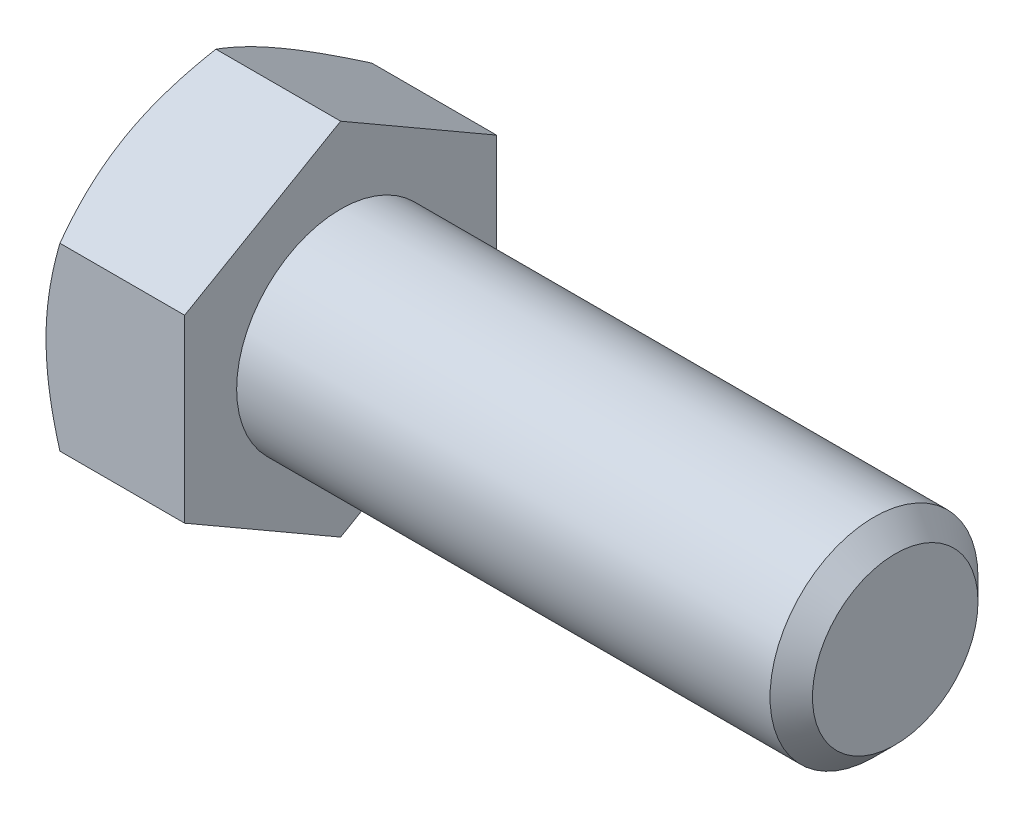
ISO-10303-21;
HEADER;
FILE_DESCRIPTION(('STEP AP214'),'2;1');
FILE_NAME('part.step','',(''),(''),'','','');
FILE_SCHEMA(('AUTOMOTIVE_DESIGN { 1 0 10303 214 1 1 1 1 }'));
ENDSEC;
DATA;
#1=APPLICATION_CONTEXT('core data for automotive mechanical design processes');
#2=APPLICATION_PROTOCOL_DEFINITION('international standard','automotive_design',2000,#1);
#3=PRODUCT_CONTEXT('',#1,'mechanical');
#4=PRODUCT('Part','Part','',(#3));
#5=PRODUCT_RELATED_PRODUCT_CATEGORY('part','',(#4));
#6=PRODUCT_DEFINITION_FORMATION('','',#4);
#7=PRODUCT_DEFINITION_CONTEXT('part definition',#1,'design');
#8=PRODUCT_DEFINITION('design','',#6,#7);
#9=PRODUCT_DEFINITION_SHAPE('','',#8);
#10=(LENGTH_UNIT() NAMED_UNIT(*) SI_UNIT(.MILLI.,.METRE.));
#11=(NAMED_UNIT(*) PLANE_ANGLE_UNIT() SI_UNIT($,.RADIAN.));
#12=(NAMED_UNIT(*) SI_UNIT($,.STERADIAN.) SOLID_ANGLE_UNIT());
#13=UNCERTAINTY_MEASURE_WITH_UNIT(LENGTH_MEASURE(1.E-05),#10,'distance_accuracy_value','');
#14=(GEOMETRIC_REPRESENTATION_CONTEXT(3) GLOBAL_UNCERTAINTY_ASSIGNED_CONTEXT((#13)) GLOBAL_UNIT_ASSIGNED_CONTEXT((#10,
#11,#12)) REPRESENTATION_CONTEXT('',''));
#15=CARTESIAN_POINT('',(0.,0.,0.));
#16=DIRECTION('',(0.,0.,1.));
#17=DIRECTION('',(1.,0.,0.));
#18=AXIS2_PLACEMENT_3D('',#15,#16,#17);
#19=CARTESIAN_POINT('',(-15.875,-4.12444598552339,7.14375));
#20=DIRECTION('',(0.,0.,-1.));
#21=DIRECTION('',(0.,1.,0.));
#22=AXIS2_PLACEMENT_3D('',#19,#20,#21);
#23=PLANE('',#22);
#24=CARTESIAN_POINT('',(-12.2837107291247,-11.2944476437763,7.14375));
#25=CARTESIAN_POINT('',(-12.4368470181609,-10.9805232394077,7.14375));
#26=CARTESIAN_POINT('',(-12.5885759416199,-10.6659008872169,7.14375));
#27=CARTESIAN_POINT('',(-12.8884314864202,-10.0348898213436,7.14375));
#28=CARTESIAN_POINT('',(-13.0365575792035,-9.71850085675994,7.14375));
#29=CARTESIAN_POINT('',(-13.3291194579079,-9.08205743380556,7.14375));
#30=CARTESIAN_POINT('',(-13.4735325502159,-8.76199250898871,7.14375));
#31=CARTESIAN_POINT('',(-13.756729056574,-8.1193909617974,7.14375));
#32=CARTESIAN_POINT('',(-13.8955127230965,-7.79685445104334,7.14375));
#33=CARTESIAN_POINT('',(-14.1706162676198,-7.13766604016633,7.14375));
#34=CARTESIAN_POINT('',(-14.3066876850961,-6.80090989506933,7.14375));
#35=CARTESIAN_POINT('',(-14.5690446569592,-6.12353919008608,7.14375));
#36=CARTESIAN_POINT('',(-14.6953291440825,-5.78292421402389,7.14375));
#37=CARTESIAN_POINT('',(-14.9349543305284,-5.09786024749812,7.14375));
#38=CARTESIAN_POINT('',(-15.048319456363,-4.75341989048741,7.14375));
#39=CARTESIAN_POINT('',(-15.2586129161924,-4.05961513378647,7.14375));
#40=CARTESIAN_POINT('',(-15.3555462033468,-3.71025225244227,7.14375));
#41=CARTESIAN_POINT('',(-15.5279472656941,-3.00829070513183,7.14375));
#42=CARTESIAN_POINT('',(-15.6035368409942,-2.65572276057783,7.14375));
#43=CARTESIAN_POINT('',(-15.6977473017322,-2.12349462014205,7.14375));
#44=CARTESIAN_POINT('',(-15.7259563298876,-1.94551103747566,7.14375));
#45=CARTESIAN_POINT('',(-15.7754356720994,-1.58858869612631,7.14375));
#46=CARTESIAN_POINT('',(-15.7967066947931,-1.40965003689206,7.14375));
#47=CARTESIAN_POINT('',(-15.8316079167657,-1.05348730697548,7.14375));
#48=CARTESIAN_POINT('',(-15.8453382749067,-0.87627309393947,7.14375));
#49=CARTESIAN_POINT('',(-15.8652847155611,-0.521422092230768,7.14375));
#50=CARTESIAN_POINT('',(-15.8715009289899,-0.343785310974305,7.14375));
#51=CARTESIAN_POINT('',(-15.8762697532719,0.0115936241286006,7.14375));
#52=CARTESIAN_POINT('',(-15.8748223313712,0.189335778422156,7.14375));
#53=CARTESIAN_POINT('',(-15.8643014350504,0.54459618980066,7.14375));
#54=CARTESIAN_POINT('',(-15.8552276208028,0.722114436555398,7.14375));
#55=CARTESIAN_POINT('',(-15.8249195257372,1.14231672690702,7.14375));
#56=CARTESIAN_POINT('',(-15.8004249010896,1.38477115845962,7.14375));
#57=CARTESIAN_POINT('',(-15.7384979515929,1.86800860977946,7.14375));
#58=CARTESIAN_POINT('',(-15.7010640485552,2.10879142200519,7.14375));
#59=CARTESIAN_POINT('',(-15.5713280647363,2.82827840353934,7.14375));
#60=CARTESIAN_POINT('',(-15.4616106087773,3.30389106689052,7.14375));
#61=CARTESIAN_POINT('',(-15.2696836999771,4.01550298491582,7.14375));
#62=CARTESIAN_POINT('',(-15.2001876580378,4.2551445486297,7.14375));
#63=CARTESIAN_POINT('',(-15.0535636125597,4.73210450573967,7.14375));
#64=CARTESIAN_POINT('',(-14.9764355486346,4.96942288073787,7.14375));
#65=CARTESIAN_POINT('',(-14.8158189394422,5.4418061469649,7.14375));
#66=CARTESIAN_POINT('',(-14.7323321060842,5.67687162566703,7.14375));
#67=CARTESIAN_POINT('',(-14.5600214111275,6.14502503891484,7.14375));
#68=CARTESIAN_POINT('',(-14.4711976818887,6.37811302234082,7.14375));
#69=CARTESIAN_POINT('',(-14.220948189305,7.01633974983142,7.14375));
#70=CARTESIAN_POINT('',(-14.0549401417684,7.41968025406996,7.14375));
#71=CARTESIAN_POINT('',(-13.7128746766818,8.22209357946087,7.14375));
#72=CARTESIAN_POINT('',(-13.5368160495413,8.62116588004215,7.14375));
#73=CARTESIAN_POINT('',(-13.1770756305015,9.41604681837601,7.14375));
#74=CARTESIAN_POINT('',(-12.99339071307,9.81185403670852,7.14375));
#75=CARTESIAN_POINT('',(-12.6202597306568,10.600712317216,7.14375));
#76=CARTESIAN_POINT('',(-12.4308139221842,10.9937635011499,7.14375));
#77=CARTESIAN_POINT('',(-12.0471131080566,11.7783335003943,7.14375));
#78=CARTESIAN_POINT('',(-11.8528504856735,12.1698485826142,7.14375));
#79=CARTESIAN_POINT('',(-11.4607727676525,12.9510972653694,7.14375));
#80=CARTESIAN_POINT('',(-11.2629576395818,13.3408308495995,7.14375));
#81=CARTESIAN_POINT('',(-10.8645317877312,14.1187472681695,7.14375));
#82=CARTESIAN_POINT('',(-10.66392174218,14.5069304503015,7.14375));
#83=CARTESIAN_POINT('',(-10.2603913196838,15.2820948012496,7.14375));
#84=CARTESIAN_POINT('',(-10.0574709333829,15.6690759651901,7.14375));
#85=CARTESIAN_POINT('',(-9.49034733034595,16.7442233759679,7.14375));
#86=CARTESIAN_POINT('',(-9.12409176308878,17.4313067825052,7.14375));
#87=CARTESIAN_POINT('',(-8.38723567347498,18.8031936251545,7.14375));
#88=CARTESIAN_POINT('',(-8.01663486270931,19.4879969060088,7.14375));
#89=CARTESIAN_POINT('',(-7.27352014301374,20.8534506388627,7.14375));
#90=CARTESIAN_POINT('',(-6.90101750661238,21.5341072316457,7.14375));
#91=CARTESIAN_POINT('',(-6.15355512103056,22.8939962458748,7.14375));
#92=CARTESIAN_POINT('',(-5.77859558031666,23.5732287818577,7.14375));
#93=CARTESIAN_POINT('',(-5.402745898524,24.2519647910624,7.14374999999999));
#94=B_SPLINE_CURVE_WITH_KNOTS('',3,(#24,#25,#26,#27,#28,#29,#30,#31,#32,#33,#34,#35,#36,#37,#38,
#39,#40,#41,#42,#43,#44,#45,#46,#47,#48,#49,#50,#51,#52,#53,#54,#55,#56,#57,#58,#59,#60,#61,#62,
#63,#64,#65,#66,#67,#68,#69,#70,#71,#72,#73,#74,#75,#76,#77,#78,#79,#80,#81,#82,#83,#84,#85,#86,
#87,#88,#89,#90,#91,#92,#93),.UNSPECIFIED.,.F.,.F.,(4,2,2,2,2,2,2,2,2,2,2,2,2,2,2,2,2,2,2,2,2,2,
2,2,2,2,2,2,2,2,2,2,2,2,4),(0.,1.04786354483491,2.0958799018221,3.14924522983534,
4.20256326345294,5.2920693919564,6.38169416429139,7.46922336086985,8.55642415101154,
9.63728918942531,10.1777908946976,10.7182373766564,11.2513201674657,11.7843936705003,
12.3174694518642,12.8505689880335,13.5812265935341,14.3119733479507,15.7741561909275,
16.522632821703,17.2711153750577,18.0193971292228,18.7676603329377,20.0759569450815,
21.384411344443,22.6934073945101,24.002345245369,25.3135047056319,26.6246761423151,
27.9355347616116,29.2463986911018,31.5821913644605,33.9181399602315,36.245893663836,
38.573452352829),.UNSPECIFIED.);
#95=CARTESIAN_POINT('',(-15.2369459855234,-4.12444598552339,7.14375));
#96=VERTEX_POINT('',#95);
#97=CARTESIAN_POINT('',(-15.875,0.,7.14375));
#98=VERTEX_POINT('',#97);
#99=EDGE_CURVE('E251',#96,#98,#94,.T.);
#100=ORIENTED_EDGE('',*,*,#99,.F.);
#101=DIRECTION('',(1.,0.,0.));
#102=VECTOR('',#101,1.);
#103=CARTESIAN_POINT('',(-15.875,-4.12444598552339,7.14375));
#104=LINE('',#103,#102);
#105=CARTESIAN_POINT('',(-9.525,-4.12444598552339,7.14375));
#106=VERTEX_POINT('',#105);
#107=EDGE_CURVE('E254',#96,#106,#104,.T.);
#108=ORIENTED_EDGE('',*,*,#107,.T.);
#109=DIRECTION('',(0.,1.,0.));
#110=VECTOR('',#109,1.);
#111=CARTESIAN_POINT('',(-9.525,-4.12444598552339,7.14375));
#112=LINE('',#111,#110);
#113=CARTESIAN_POINT('',(-9.525,4.12444598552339,7.14375));
#114=VERTEX_POINT('',#113);
#115=EDGE_CURVE('E256',#106,#114,#112,.T.);
#116=ORIENTED_EDGE('',*,*,#115,.T.);
#117=DIRECTION('',(1.,0.,0.));
#118=VECTOR('',#117,1.);
#119=CARTESIAN_POINT('',(-15.875,4.12444598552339,7.14375));
#120=LINE('',#119,#118);
#121=CARTESIAN_POINT('',(-15.2369459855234,4.12444598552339,7.14375));
#122=VERTEX_POINT('',#121);
#123=EDGE_CURVE('E224',#122,#114,#120,.T.);
#124=ORIENTED_EDGE('',*,*,#123,.F.);
#125=EDGE_CURVE('E114',#98,#122,#94,.T.);
#126=ORIENTED_EDGE('',*,*,#125,.F.);
#127=EDGE_LOOP('',(#100,#108,#116,#124,#126));
#128=FACE_BOUND('',#127,.T.);
#129=ADVANCED_FACE('F38',(#128),#23,.F.);
#130=CARTESIAN_POINT('',(-15.875,4.12444598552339,7.14375));
#131=DIRECTION('',(0.,-0.866025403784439,-0.5));
#132=DIRECTION('',(0.,0.5,-0.866025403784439));
#133=AXIS2_PLACEMENT_3D('',#130,#131,#132);
#134=PLANE('',#133);
#135=CARTESIAN_POINT('',(-15.2368793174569,4.12433051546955,7.14395));
#136=CARTESIAN_POINT('',(-15.28921396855,4.21499047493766,6.98692234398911));
#137=CARTESIAN_POINT('',(-15.3391734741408,4.30598845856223,6.82930921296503));
#138=CARTESIAN_POINT('',(-15.4336880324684,4.48872342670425,6.51280296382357));
#139=CARTESIAN_POINT('',(-15.4782407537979,4.58046071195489,6.35390932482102));
#140=CARTESIAN_POINT('',(-15.6029142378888,4.85714139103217,5.87468433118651));
#141=CARTESIAN_POINT('',(-15.6738270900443,5.04317693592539,5.55246131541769));
#142=CARTESIAN_POINT('',(-15.7569807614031,5.32157574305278,5.07026043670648));
#143=CARTESIAN_POINT('',(-15.7806688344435,5.41310718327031,4.91172333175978));
#144=CARTESIAN_POINT('',(-15.8203902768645,5.59658364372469,4.59393278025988));
#145=CARTESIAN_POINT('',(-15.8364243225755,5.6885286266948,4.43467939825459));
#146=CARTESIAN_POINT('',(-15.860429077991,5.87257827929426,4.11589604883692));
#147=CARTESIAN_POINT('',(-15.8684089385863,5.96468264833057,3.95636660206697));
#148=CARTESIAN_POINT('',(-15.8761427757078,6.14897138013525,3.63716915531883));
#149=CARTESIAN_POINT('',(-15.8758970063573,6.24115574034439,3.47750115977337));
#150=CARTESIAN_POINT('',(-15.8639170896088,6.49371006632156,3.04006423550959));
#151=CARTESIAN_POINT('',(-15.843806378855,6.65399735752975,2.76243850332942));
#152=CARTESIAN_POINT('',(-15.780035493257,6.97350732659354,2.20903100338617));
#153=CARTESIAN_POINT('',(-15.7363535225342,7.13272888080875,1.93325118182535));
#154=CARTESIAN_POINT('',(-15.6271614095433,7.45288184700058,1.37872997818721));
#155=CARTESIAN_POINT('',(-15.5611886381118,7.61377286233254,1.10005856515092));
#156=CARTESIAN_POINT('',(-15.4114571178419,7.93315557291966,0.546871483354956));
#157=CARTESIAN_POINT('',(-15.3277335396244,8.09165135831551,0.272348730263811));
#158=CARTESIAN_POINT('',(-15.2368793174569,8.24900744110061,-0.000200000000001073));
#159=B_SPLINE_CURVE_WITH_KNOTS('',3,(#135,#136,#137,#138,#139,#140,#141,#142,#143,#144,#145,
#146,#147,#148,#149,#150,#151,#152,#153,#154,#155,#156,#157,#158),.UNSPECIFIED.,.F.,.F.,(4,2,2,
2,2,2,2,2,2,2,2,4),(0.,0.566119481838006,1.13248221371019,2.2675610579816,2.82119915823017,
3.37478832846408,3.92774781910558,4.48069022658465,5.44329448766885,6.4067903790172,
7.39165514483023,8.37458648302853),.UNSPECIFIED.);
#160=CARTESIAN_POINT('',(-15.875,6.18666897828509,3.571875));
#161=VERTEX_POINT('',#160);
#162=EDGE_CURVE('E110',#122,#161,#159,.T.);
#163=ORIENTED_EDGE('',*,*,#162,.F.);
#164=ORIENTED_EDGE('',*,*,#123,.T.);
#165=DIRECTION('',(0.,0.5,-0.866025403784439));
#166=VECTOR('',#165,1.);
#167=CARTESIAN_POINT('',(-9.525,4.12444598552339,7.14375));
#168=LINE('',#167,#166);
#169=CARTESIAN_POINT('',(-9.525,8.24889197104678,0.));
#170=VERTEX_POINT('',#169);
#171=EDGE_CURVE('E274',#114,#170,#168,.T.);
#172=ORIENTED_EDGE('',*,*,#171,.T.);
#173=DIRECTION('',(1.,0.,0.));
#174=VECTOR('',#173,1.);
#175=CARTESIAN_POINT('',(-15.875,8.24889197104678,0.));
#176=LINE('',#175,#174);
#177=CARTESIAN_POINT('',(-15.2369459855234,8.24889197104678,0.));
#178=VERTEX_POINT('',#177);
#179=EDGE_CURVE('E133',#178,#170,#176,.T.);
#180=ORIENTED_EDGE('',*,*,#179,.F.);
#181=EDGE_CURVE('E118',#161,#178,#159,.T.);
#182=ORIENTED_EDGE('',*,*,#181,.F.);
#183=EDGE_LOOP('',(#163,#164,#172,#180,#182));
#184=FACE_BOUND('',#183,.T.);
#185=ADVANCED_FACE('F131',(#184),#134,.F.);
#186=CARTESIAN_POINT('',(-15.875,8.24889197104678,0.));
#187=DIRECTION('',(0.,-0.866025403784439,0.5));
#188=DIRECTION('',(0.,-0.5,-0.866025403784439));
#189=AXIS2_PLACEMENT_3D('',#186,#187,#188);
#190=PLANE('',#189);
#191=CARTESIAN_POINT('',(-15.2368793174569,8.24900744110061,0.000199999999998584));
#192=CARTESIAN_POINT('',(-15.28921396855,8.15834748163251,-0.156827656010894));
#193=CARTESIAN_POINT('',(-15.3391734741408,8.06734949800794,-0.314440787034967));
#194=CARTESIAN_POINT('',(-15.4336880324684,7.88461452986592,-0.630947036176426));
#195=CARTESIAN_POINT('',(-15.4782407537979,7.79287724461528,-0.789840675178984));
#196=CARTESIAN_POINT('',(-15.6029142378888,7.51619656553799,-1.2690656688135));
#197=CARTESIAN_POINT('',(-15.6738270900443,7.33016102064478,-1.59128868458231));
#198=CARTESIAN_POINT('',(-15.7569807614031,7.05176221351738,-2.07348956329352));
#199=CARTESIAN_POINT('',(-15.7806688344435,6.96023077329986,-2.23202666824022));
#200=CARTESIAN_POINT('',(-15.8203902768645,6.77675431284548,-2.54981721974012));
#201=CARTESIAN_POINT('',(-15.8364243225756,6.68480932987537,-2.70907060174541));
#202=CARTESIAN_POINT('',(-15.860429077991,6.5007596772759,-3.02785395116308));
#203=CARTESIAN_POINT('',(-15.8684089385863,6.4086553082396,-3.18738339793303));
#204=CARTESIAN_POINT('',(-15.8761427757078,6.22436657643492,-3.50658084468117));
#205=CARTESIAN_POINT('',(-15.8758970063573,6.13218221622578,-3.66624884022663));
#206=CARTESIAN_POINT('',(-15.8639170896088,5.8796278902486,-4.10368576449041));
#207=CARTESIAN_POINT('',(-15.843806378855,5.71934059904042,-4.38131149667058));
#208=CARTESIAN_POINT('',(-15.780035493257,5.39983062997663,-4.93471899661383));
#209=CARTESIAN_POINT('',(-15.7363535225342,5.24060907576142,-5.21049881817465));
#210=CARTESIAN_POINT('',(-15.6271614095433,4.92045610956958,-5.76502002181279));
#211=CARTESIAN_POINT('',(-15.5611886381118,4.75956509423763,-6.04369143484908));
#212=CARTESIAN_POINT('',(-15.4114571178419,4.4401823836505,-6.59687851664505));
#213=CARTESIAN_POINT('',(-15.3277335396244,4.28168659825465,-6.87140126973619));
#214=CARTESIAN_POINT('',(-15.2368793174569,4.12433051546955,-7.14395));
#215=B_SPLINE_CURVE_WITH_KNOTS('',3,(#191,#192,#193,#194,#195,#196,#197,#198,#199,#200,#201,
#202,#203,#204,#205,#206,#207,#208,#209,#210,#211,#212,#213,#214),.UNSPECIFIED.,.F.,.F.,(4,2,2,
2,2,2,2,2,2,2,2,4),(0.,0.566119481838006,1.13248221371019,2.2675610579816,2.82119915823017,
3.37478832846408,3.92774781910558,4.48069022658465,5.44329448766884,6.4067903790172,
7.39165514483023,8.37458648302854),.UNSPECIFIED.);
#216=CARTESIAN_POINT('',(-15.875,6.18666897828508,-3.571875));
#217=VERTEX_POINT('',#216);
#218=EDGE_CURVE('E123',#178,#217,#215,.T.);
#219=ORIENTED_EDGE('',*,*,#218,.F.);
#220=ORIENTED_EDGE('',*,*,#179,.T.);
#221=DIRECTION('',(0.,-0.5,-0.866025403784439));
#222=VECTOR('',#221,1.);
#223=CARTESIAN_POINT('',(-9.525,8.24889197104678,0.));
#224=LINE('',#223,#222);
#225=CARTESIAN_POINT('',(-9.525,4.12444598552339,-7.14375));
#226=VERTEX_POINT('',#225);
#227=EDGE_CURVE('E271',#170,#226,#224,.T.);
#228=ORIENTED_EDGE('',*,*,#227,.T.);
#229=DIRECTION('',(1.,0.,0.));
#230=VECTOR('',#229,1.);
#231=CARTESIAN_POINT('',(-15.875,4.12444598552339,-7.14375));
#232=LINE('',#231,#230);
#233=CARTESIAN_POINT('',(-15.2369459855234,4.12444598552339,-7.14375));
#234=VERTEX_POINT('',#233);
#235=EDGE_CURVE('E268',#234,#226,#232,.T.);
#236=ORIENTED_EDGE('',*,*,#235,.F.);
#237=EDGE_CURVE('E134',#217,#234,#215,.T.);
#238=ORIENTED_EDGE('',*,*,#237,.F.);
#239=EDGE_LOOP('',(#219,#220,#228,#236,#238));
#240=FACE_BOUND('',#239,.T.);
#241=ADVANCED_FACE('F188',(#240),#190,.F.);
#242=CARTESIAN_POINT('',(-15.875,4.12444598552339,-7.14375));
#243=DIRECTION('',(0.,0.,1.));
#244=DIRECTION('',(0.,-1.,0.));
#245=AXIS2_PLACEMENT_3D('',#242,#243,#244);
#246=PLANE('',#245);
#247=CARTESIAN_POINT('',(-12.283710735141,-11.2944476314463,-7.14375));
#248=CARTESIAN_POINT('',(-12.4368470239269,-10.980523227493,-7.14375));
#249=CARTESIAN_POINT('',(-12.5885759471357,-10.6659008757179,-7.14375));
#250=CARTESIAN_POINT('',(-12.8884314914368,-10.0348898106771,-7.14375));
#251=CARTESIAN_POINT('',(-13.036557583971,-9.7185008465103,-7.14375));
#252=CARTESIAN_POINT('',(-13.3291194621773,-9.08205742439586,-7.14375));
#253=CARTESIAN_POINT('',(-13.4735325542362,-8.7619925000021,-7.14375));
#254=CARTESIAN_POINT('',(-13.7567290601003,-8.11939095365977,-7.14375));
#255=CARTESIAN_POINT('',(-13.8955127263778,-7.79685444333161,-7.14375));
#256=CARTESIAN_POINT('',(-14.1706162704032,-7.13766603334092,-7.14375));
#257=CARTESIAN_POINT('',(-14.3066876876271,-6.80090988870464,-7.14375));
#258=CARTESIAN_POINT('',(-14.5690446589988,-6.12353918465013,-7.14375));
#259=CARTESIAN_POINT('',(-14.6953291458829,-5.78292420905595,-7.14375));
#260=CARTESIAN_POINT('',(-14.9349543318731,-5.09786024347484,-7.14375));
#261=CARTESIAN_POINT('',(-15.048319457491,-4.75341988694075,-7.14375));
#262=CARTESIAN_POINT('',(-15.2586129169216,-4.05961513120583,-7.14375));
#263=CARTESIAN_POINT('',(-15.355546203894,-3.71025225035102,-7.14375));
#264=CARTESIAN_POINT('',(-15.5279472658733,-3.00829070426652,-7.14375));
#265=CARTESIAN_POINT('',(-15.6035368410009,-2.65572276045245,-7.14375));
#266=CARTESIAN_POINT('',(-15.6977473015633,-2.12349462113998,-7.14375));
#267=CARTESIAN_POINT('',(-15.7259563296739,-1.94551103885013,-7.14375));
#268=CARTESIAN_POINT('',(-15.7754356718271,-1.5885886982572,-7.14375));
#269=CARTESIAN_POINT('',(-15.7967066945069,-1.40965003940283,-7.14375));
#270=CARTESIAN_POINT('',(-15.8316079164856,-1.05348731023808,-7.14375));
#271=CARTESIAN_POINT('',(-15.8453382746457,-0.876273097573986,-7.14375));
#272=CARTESIAN_POINT('',(-15.8652847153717,-0.521422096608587,-7.14375));
#273=CARTESIAN_POINT('',(-15.8715009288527,-0.343785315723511,-7.14375));
#274=CARTESIAN_POINT('',(-15.8762697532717,0.0115936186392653,-7.14375));
#275=CARTESIAN_POINT('',(-15.8748223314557,0.189335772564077,-7.14375));
#276=CARTESIAN_POINT('',(-15.8643014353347,0.544596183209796,-7.14375));
#277=CARTESIAN_POINT('',(-15.8552276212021,0.722114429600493,-7.14375));
#278=CARTESIAN_POINT('',(-15.8249195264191,1.14231671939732,-7.14375));
#279=CARTESIAN_POINT('',(-15.8004249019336,1.3847711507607,-7.14375));
#280=CARTESIAN_POINT('',(-15.7384979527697,1.8680086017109,-7.14375));
#281=CARTESIAN_POINT('',(-15.7010640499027,2.1087914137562,-7.14375));
#282=CARTESIAN_POINT('',(-15.5713280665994,2.8282783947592,-7.14375));
#283=CARTESIAN_POINT('',(-15.4616106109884,3.30389105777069,-7.14375));
#284=CARTESIAN_POINT('',(-15.2696837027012,4.015502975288,-7.14375));
#285=CARTESIAN_POINT('',(-15.2001876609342,4.25514453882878,-7.14375));
#286=CARTESIAN_POINT('',(-15.0535636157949,4.7321044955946,-7.14375));
#287=CARTESIAN_POINT('',(-14.9764355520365,4.96942287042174,-7.14375));
#288=CARTESIAN_POINT('',(-14.8158189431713,5.44180613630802,-7.14375));
#289=CARTESIAN_POINT('',(-14.7323321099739,5.67687161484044,-7.14375));
#290=CARTESIAN_POINT('',(-14.5600214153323,6.14502502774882,-7.14375));
#291=CARTESIAN_POINT('',(-14.4711976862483,6.37811301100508,-7.14375));
#292=CARTESIAN_POINT('',(-14.2209481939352,7.01633973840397,-7.14375));
#293=CARTESIAN_POINT('',(-14.0549401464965,7.41968024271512,-7.14375));
#294=CARTESIAN_POINT('',(-13.7128746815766,8.22209356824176,-7.14375));
#295=CARTESIAN_POINT('',(-13.5368160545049,8.62116586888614,-7.14375));
#296=CARTESIAN_POINT('',(-13.1770756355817,9.41604680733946,-7.14375));
#297=CARTESIAN_POINT('',(-12.9933907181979,9.81185402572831,-7.14375));
#298=CARTESIAN_POINT('',(-12.6202597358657,10.6007123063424,-7.14375));
#299=CARTESIAN_POINT('',(-12.4308139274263,10.9937634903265,-7.14375));
#300=CARTESIAN_POINT('',(-12.0471131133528,11.7783334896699,-7.14375));
#301=CARTESIAN_POINT('',(-11.8528504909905,12.1698485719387,-7.14375));
#302=CARTESIAN_POINT('',(-11.4607727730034,12.951097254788,-7.14375));
#303=CARTESIAN_POINT('',(-11.2629576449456,13.3408308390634,-7.14375));
#304=CARTESIAN_POINT('',(-10.8645317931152,14.1187472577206,-7.14375));
#305=CARTESIAN_POINT('',(-10.6639217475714,14.5069304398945,-7.14375000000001));
#306=CARTESIAN_POINT('',(-10.2603913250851,15.2820947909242,-7.14375000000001));
#307=CARTESIAN_POINT('',(-10.057470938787,15.6690759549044,-7.14375000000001));
#308=CARTESIAN_POINT('',(-9.49034733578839,16.744223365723,-7.14375000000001));
#309=CARTESIAN_POINT('',(-9.12409176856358,17.4313067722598,-7.14375000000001));
#310=CARTESIAN_POINT('',(-8.38723567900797,18.8031936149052,-7.14375000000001));
#311=CARTESIAN_POINT('',(-8.01663486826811,19.487996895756,-7.14375000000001));
#312=CARTESIAN_POINT('',(-7.27352014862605,20.853450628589,-7.14375000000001));
#313=CARTESIAN_POINT('',(-6.90101751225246,21.5341072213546,-7.14375000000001));
#314=CARTESIAN_POINT('',(-6.15355512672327,22.8939962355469,-7.14375000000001));
#315=CARTESIAN_POINT('',(-5.77859558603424,23.5732287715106,-7.14375000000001));
#316=CARTESIAN_POINT('',(-5.40274590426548,24.2519647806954,-7.14375000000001));
#317=B_SPLINE_CURVE_WITH_KNOTS('',3,(#247,#248,#249,#250,#251,#252,#253,#254,#255,#256,#257,
#258,#259,#260,#261,#262,#263,#264,#265,#266,#267,#268,#269,#270,#271,#272,#273,#274,#275,#276,
#277,#278,#279,#280,#281,#282,#283,#284,#285,#286,#287,#288,#289,#290,#291,#292,#293,#294,#295,
#296,#297,#298,#299,#300,#301,#302,#303,#304,#305,#306,#307,#308,#309,#310,#311,#312,#313,#314,
#315,#316),.UNSPECIFIED.,.F.,.F.,(4,2,2,2,2,2,2,2,2,2,2,2,2,2,2,2,2,2,2,2,2,2,2,2,2,2,2,2,2,2,2,
2,2,2,4),(0.,1.04786354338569,2.09587989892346,3.14924522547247,4.20256325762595,
5.2920693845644,6.38169415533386,7.46922335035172,8.55642413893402,9.63728917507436,
10.1777908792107,10.7182373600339,11.2513201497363,11.784393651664,12.3174694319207,
12.8505689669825,13.5812265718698,14.3119733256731,15.7741561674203,16.5226327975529,
17.2711153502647,18.0193971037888,18.7676603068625,20.0759569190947,21.3844113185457,
22.6934073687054,24.0023452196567,25.3135046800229,26.6246761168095,27.9355347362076,
29.2463986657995,31.5821913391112,33.9181399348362,36.2458936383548,38.573452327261),.UNSPECIFIED.);
#318=CARTESIAN_POINT('',(-15.875,0.,-7.14375));
#319=VERTEX_POINT('',#318);
#320=EDGE_CURVE('E182',#234,#319,#317,.F.);
#321=ORIENTED_EDGE('',*,*,#320,.F.);
#322=ORIENTED_EDGE('',*,*,#235,.T.);
#323=DIRECTION('',(0.,-1.,0.));
#324=VECTOR('',#323,1.);
#325=CARTESIAN_POINT('',(-9.525,4.12444598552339,-7.14375));
#326=LINE('',#325,#324);
#327=CARTESIAN_POINT('',(-9.525,-4.12444598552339,-7.14375));
#328=VERTEX_POINT('',#327);
#329=EDGE_CURVE('E278',#226,#328,#326,.T.);
#330=ORIENTED_EDGE('',*,*,#329,.T.);
#331=DIRECTION('',(1.,0.,0.));
#332=VECTOR('',#331,1.);
#333=CARTESIAN_POINT('',(-15.875,-4.12444598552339,-7.14375));
#334=LINE('',#333,#332);
#335=CARTESIAN_POINT('',(-15.2369459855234,-4.12444598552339,-7.14375));
#336=VERTEX_POINT('',#335);
#337=EDGE_CURVE('E239',#336,#328,#334,.T.);
#338=ORIENTED_EDGE('',*,*,#337,.F.);
#339=EDGE_CURVE('E177',#319,#336,#317,.F.);
#340=ORIENTED_EDGE('',*,*,#339,.F.);
#341=EDGE_LOOP('',(#321,#322,#330,#338,#340));
#342=FACE_BOUND('',#341,.T.);
#343=ADVANCED_FACE('F184',(#342),#246,.F.);
#344=CARTESIAN_POINT('',(-15.875,-4.12444598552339,-7.14375));
#345=DIRECTION('',(0.,0.866025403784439,0.5));
#346=DIRECTION('',(0.,-0.5,0.866025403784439));
#347=AXIS2_PLACEMENT_3D('',#344,#345,#346);
#348=PLANE('',#347);
#349=CARTESIAN_POINT('',(-15.2368793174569,-4.12433051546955,-7.14395));
#350=CARTESIAN_POINT('',(-15.28921396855,-4.21499047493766,-6.98692234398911));
#351=CARTESIAN_POINT('',(-15.3391734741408,-4.30598845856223,-6.82930921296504));
#352=CARTESIAN_POINT('',(-15.4336880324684,-4.48872342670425,-6.51280296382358));
#353=CARTESIAN_POINT('',(-15.4782407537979,-4.58046071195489,-6.35390932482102));
#354=CARTESIAN_POINT('',(-15.6029142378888,-4.85714139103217,-5.87468433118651));
#355=CARTESIAN_POINT('',(-15.6738270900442,-5.04317693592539,-5.55246131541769));
#356=CARTESIAN_POINT('',(-15.7569807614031,-5.32157574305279,-5.07026043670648));
#357=CARTESIAN_POINT('',(-15.7806688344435,-5.41310718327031,-4.91172333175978));
#358=CARTESIAN_POINT('',(-15.8203902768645,-5.59658364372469,-4.59393278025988));
#359=CARTESIAN_POINT('',(-15.8364243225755,-5.6885286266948,-4.43467939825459));
#360=CARTESIAN_POINT('',(-15.860429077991,-5.87257827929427,-4.11589604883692));
#361=CARTESIAN_POINT('',(-15.8684089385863,-5.96468264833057,-3.95636660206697));
#362=CARTESIAN_POINT('',(-15.8761427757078,-6.14897138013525,-3.63716915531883));
#363=CARTESIAN_POINT('',(-15.8758970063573,-6.24115574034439,-3.47750115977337));
#364=CARTESIAN_POINT('',(-15.8639170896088,-6.49371006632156,-3.04006423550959));
#365=CARTESIAN_POINT('',(-15.843806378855,-6.65399735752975,-2.76243850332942));
#366=CARTESIAN_POINT('',(-15.780035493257,-6.97350732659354,-2.20903100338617));
#367=CARTESIAN_POINT('',(-15.7363535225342,-7.13272888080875,-1.93325118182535));
#368=CARTESIAN_POINT('',(-15.6271614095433,-7.45288184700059,-1.37872997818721));
#369=CARTESIAN_POINT('',(-15.5611886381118,-7.61377286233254,-1.10005856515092));
#370=CARTESIAN_POINT('',(-15.4114571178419,-7.93315557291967,-0.546871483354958));
#371=CARTESIAN_POINT('',(-15.3277335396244,-8.09165135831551,-0.272348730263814));
#372=CARTESIAN_POINT('',(-15.2368793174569,-8.24900744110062,0.000199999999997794));
#373=B_SPLINE_CURVE_WITH_KNOTS('',3,(#349,#350,#351,#352,#353,#354,#355,#356,#357,#358,#359,
#360,#361,#362,#363,#364,#365,#366,#367,#368,#369,#370,#371,#372),.UNSPECIFIED.,.F.,.F.,(4,2,2,
2,2,2,2,2,2,2,2,4),(0.,0.566119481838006,1.13248221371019,2.2675610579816,2.82119915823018,
3.37478832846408,3.92774781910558,4.48069022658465,5.44329448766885,6.4067903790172,
7.39165514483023,8.37458648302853),.UNSPECIFIED.);
#374=CARTESIAN_POINT('',(-15.875,-6.18666897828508,-3.571875));
#375=VERTEX_POINT('',#374);
#376=EDGE_CURVE('E183',#336,#375,#373,.T.);
#377=ORIENTED_EDGE('',*,*,#376,.F.);
#378=ORIENTED_EDGE('',*,*,#337,.T.);
#379=DIRECTION('',(0.,-0.5,0.866025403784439));
#380=VECTOR('',#379,1.);
#381=CARTESIAN_POINT('',(-9.525,-4.12444598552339,-7.14375));
#382=LINE('',#381,#380);
#383=CARTESIAN_POINT('',(-9.525,-8.24889197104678,0.));
#384=VERTEX_POINT('',#383);
#385=EDGE_CURVE('E263',#328,#384,#382,.T.);
#386=ORIENTED_EDGE('',*,*,#385,.T.);
#387=DIRECTION('',(1.,0.,0.));
#388=VECTOR('',#387,1.);
#389=CARTESIAN_POINT('',(-15.875,-8.24889197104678,0.));
#390=LINE('',#389,#388);
#391=CARTESIAN_POINT('',(-15.2369459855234,-8.24889197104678,0.));
#392=VERTEX_POINT('',#391);
#393=EDGE_CURVE('E260',#392,#384,#390,.T.);
#394=ORIENTED_EDGE('',*,*,#393,.F.);
#395=EDGE_CURVE('E172',#375,#392,#373,.T.);
#396=ORIENTED_EDGE('',*,*,#395,.F.);
#397=EDGE_LOOP('',(#377,#378,#386,#394,#396));
#398=FACE_BOUND('',#397,.T.);
#399=ADVANCED_FACE('F187',(#398),#348,.F.);
#400=CARTESIAN_POINT('',(-15.875,-8.24889197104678,0.));
#401=DIRECTION('',(0.,0.866025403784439,-0.5));
#402=DIRECTION('',(0.,0.5,0.866025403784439));
#403=AXIS2_PLACEMENT_3D('',#400,#401,#402);
#404=PLANE('',#403);
#405=CARTESIAN_POINT('',(-15.2368793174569,-8.24900744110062,-0.000200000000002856));
#406=CARTESIAN_POINT('',(-15.28921396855,-8.15834748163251,0.156827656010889));
#407=CARTESIAN_POINT('',(-15.3391734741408,-8.06734949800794,0.314440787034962));
#408=CARTESIAN_POINT('',(-15.4336880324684,-7.88461452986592,0.630947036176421));
#409=CARTESIAN_POINT('',(-15.4782407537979,-7.79287724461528,0.78984067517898));
#410=CARTESIAN_POINT('',(-15.6029142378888,-7.516196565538,1.26906566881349));
#411=CARTESIAN_POINT('',(-15.6738270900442,-7.33016102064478,1.59128868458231));
#412=CARTESIAN_POINT('',(-15.7569807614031,-7.05176221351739,2.07348956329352));
#413=CARTESIAN_POINT('',(-15.7806688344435,-6.96023077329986,2.23202666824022));
#414=CARTESIAN_POINT('',(-15.8203902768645,-6.77675431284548,2.54981721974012));
#415=CARTESIAN_POINT('',(-15.8364243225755,-6.68480932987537,2.7090706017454));
#416=CARTESIAN_POINT('',(-15.860429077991,-6.50075967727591,3.02785395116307));
#417=CARTESIAN_POINT('',(-15.8684089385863,-6.4086553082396,3.18738339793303));
#418=CARTESIAN_POINT('',(-15.8761427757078,-6.22436657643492,3.50658084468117));
#419=CARTESIAN_POINT('',(-15.8758970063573,-6.13218221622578,3.66624884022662));
#420=CARTESIAN_POINT('',(-15.8639170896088,-5.87962789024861,4.10368576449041));
#421=CARTESIAN_POINT('',(-15.843806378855,-5.71934059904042,4.38131149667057));
#422=CARTESIAN_POINT('',(-15.780035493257,-5.39983062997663,4.93471899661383));
#423=CARTESIAN_POINT('',(-15.7363535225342,-5.24060907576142,5.21049881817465));
#424=CARTESIAN_POINT('',(-15.6271614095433,-4.92045610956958,5.76502002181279));
#425=CARTESIAN_POINT('',(-15.5611886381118,-4.75956509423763,6.04369143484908));
#426=CARTESIAN_POINT('',(-15.4114571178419,-4.4401823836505,6.59687851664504));
#427=CARTESIAN_POINT('',(-15.3277335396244,-4.28168659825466,6.87140126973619));
#428=CARTESIAN_POINT('',(-15.2368793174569,-4.12433051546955,7.14395));
#429=B_SPLINE_CURVE_WITH_KNOTS('',3,(#405,#406,#407,#408,#409,#410,#411,#412,#413,#414,#415,
#416,#417,#418,#419,#420,#421,#422,#423,#424,#425,#426,#427,#428),.UNSPECIFIED.,.F.,.F.,(4,2,2,
2,2,2,2,2,2,2,2,4),(0.,0.566119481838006,1.13248221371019,2.2675610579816,2.82119915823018,
3.37478832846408,3.92774781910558,4.48069022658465,5.44329448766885,6.4067903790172,
7.39165514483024,8.37458648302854),.UNSPECIFIED.);
#430=CARTESIAN_POINT('',(-15.875,-6.18666897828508,3.571875));
#431=VERTEX_POINT('',#430);
#432=EDGE_CURVE('E246',#392,#431,#429,.T.);
#433=ORIENTED_EDGE('',*,*,#432,.F.);
#434=ORIENTED_EDGE('',*,*,#393,.T.);
#435=DIRECTION('',(0.,0.5,0.866025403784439));
#436=VECTOR('',#435,1.);
#437=CARTESIAN_POINT('',(-9.525,-8.24889197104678,0.));
#438=LINE('',#437,#436);
#439=EDGE_CURVE('E258',#384,#106,#438,.T.);
#440=ORIENTED_EDGE('',*,*,#439,.T.);
#441=ORIENTED_EDGE('',*,*,#107,.F.);
#442=EDGE_CURVE('E128',#431,#96,#429,.T.);
#443=ORIENTED_EDGE('',*,*,#442,.F.);
#444=EDGE_LOOP('',(#433,#434,#440,#441,#443));
#445=FACE_BOUND('',#444,.T.);
#446=ADVANCED_FACE('F209',(#445),#404,.F.);
#447=CARTESIAN_POINT('',(-9.525,0.,0.));
#448=DIRECTION('',(1.,0.,0.));
#449=DIRECTION('',(0.,0.,-1.));
#450=AXIS2_PLACEMENT_3D('',#447,#448,#449);
#451=CYLINDRICAL_SURFACE('',#450,4.7625);
#452=CARTESIAN_POINT('',(14.90345,0.,0.));
#453=DIRECTION('',(1.,0.,0.));
#454=DIRECTION('',(0.,0.,-1.));
#455=AXIS2_PLACEMENT_3D('',#452,#453,#454);
#456=CIRCLE('',#455,4.7625);
#457=CARTESIAN_POINT('',(14.90345,0.,-4.7625));
#458=VERTEX_POINT('',#457);
#459=EDGE_CURVE('E218',#458,#458,#456,.F.);
#460=ORIENTED_EDGE('',*,*,#459,.T.);
#461=EDGE_LOOP('',(#460));
#462=FACE_BOUND('',#461,.T.);
#463=CARTESIAN_POINT('',(-9.525,0.,0.));
#464=DIRECTION('',(-1.,0.,0.));
#465=DIRECTION('',(0.,0.,1.));
#466=AXIS2_PLACEMENT_3D('',#463,#464,#465);
#467=CIRCLE('',#466,4.7625);
#468=CARTESIAN_POINT('',(-9.525,0.,4.7625));
#469=VERTEX_POINT('',#468);
#470=EDGE_CURVE('E221',#469,#469,#467,.F.);
#471=ORIENTED_EDGE('',*,*,#470,.T.);
#472=EDGE_LOOP('',(#471));
#473=FACE_BOUND('',#472,.T.);
#474=ADVANCED_FACE('F206',(#462,#473),#451,.T.);
#475=CARTESIAN_POINT('',(15.875,0.,0.));
#476=DIRECTION('',(1.,0.,0.));
#477=DIRECTION('',(0.,0.,-1.));
#478=AXIS2_PLACEMENT_3D('',#475,#476,#477);
#479=PLANE('',#478);
#480=CARTESIAN_POINT('',(15.875,0.,0.));
#481=DIRECTION('',(1.,0.,0.));
#482=DIRECTION('',(0.,0.,-1.));
#483=AXIS2_PLACEMENT_3D('',#480,#481,#482);
#484=CIRCLE('',#483,3.79095);
#485=CARTESIAN_POINT('',(15.875,0.,-3.79095));
#486=VERTEX_POINT('',#485);
#487=EDGE_CURVE('E223',#486,#486,#484,.T.);
#488=ORIENTED_EDGE('',*,*,#487,.T.);
#489=EDGE_LOOP('',(#488));
#490=FACE_BOUND('',#489,.T.);
#491=ADVANCED_FACE('F204',(#490),#479,.T.);
#492=CARTESIAN_POINT('',(15.875,0.,0.));
#493=DIRECTION('',(-1.,0.,0.));
#494=DIRECTION('',(0.,0.,1.));
#495=AXIS2_PLACEMENT_3D('',#492,#493,#494);
#496=CONICAL_SURFACE('',#495,3.79095,0.785398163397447);
#497=ORIENTED_EDGE('',*,*,#459,.F.);
#498=EDGE_LOOP('',(#497));
#499=FACE_BOUND('',#498,.T.);
#500=ORIENTED_EDGE('',*,*,#487,.F.);
#501=EDGE_LOOP('',(#500));
#502=FACE_BOUND('',#501,.T.);
#503=ADVANCED_FACE('F40',(#499,#502),#496,.T.);
#504=CARTESIAN_POINT('',(-9.525,4.12444598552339,7.14375));
#505=DIRECTION('',(-1.,0.,0.));
#506=DIRECTION('',(0.,0.,1.));
#507=AXIS2_PLACEMENT_3D('',#504,#505,#506);
#508=PLANE('',#507);
#509=ORIENTED_EDGE('',*,*,#470,.F.);
#510=EDGE_LOOP('',(#509));
#511=FACE_BOUND('',#510,.T.);
#512=ORIENTED_EDGE('',*,*,#115,.F.);
#513=ORIENTED_EDGE('',*,*,#439,.F.);
#514=ORIENTED_EDGE('',*,*,#385,.F.);
#515=ORIENTED_EDGE('',*,*,#329,.F.);
#516=ORIENTED_EDGE('',*,*,#227,.F.);
#517=ORIENTED_EDGE('',*,*,#171,.F.);
#518=EDGE_LOOP('',(#512,#513,#514,#515,#516,#517));
#519=FACE_BOUND('',#518,.T.);
#520=ADVANCED_FACE('F158',(#511,#519),#508,.F.);
#521=CARTESIAN_POINT('',(-15.875,0.,0.));
#522=DIRECTION('',(1.,0.,0.));
#523=DIRECTION('',(0.,0.,1.));
#524=AXIS2_PLACEMENT_3D('',#521,#522,#523);
#525=CONICAL_SURFACE('',#524,7.14375,1.0471975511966);
#526=ORIENTED_EDGE('',*,*,#99,.T.);
#527=CARTESIAN_POINT('',(-15.875,0.,0.));
#528=DIRECTION('',(-1.,0.,0.));
#529=DIRECTION('',(0.,0.,1.));
#530=AXIS2_PLACEMENT_3D('',#527,#528,#529);
#531=CIRCLE('',#530,7.14375);
#532=EDGE_CURVE('E42',#431,#98,#531,.T.);
#533=ORIENTED_EDGE('',*,*,#532,.F.);
#534=ORIENTED_EDGE('',*,*,#442,.T.);
#535=EDGE_LOOP('',(#526,#533,#534));
#536=FACE_BOUND('',#535,.T.);
#537=ADVANCED_FACE('F153',(#536),#525,.T.);
#538=ORIENTED_EDGE('',*,*,#395,.T.);
#539=ORIENTED_EDGE('',*,*,#432,.T.);
#540=EDGE_CURVE('E62',#375,#431,#531,.T.);
#541=ORIENTED_EDGE('',*,*,#540,.F.);
#542=EDGE_LOOP('',(#538,#539,#541));
#543=FACE_BOUND('',#542,.T.);
#544=ADVANCED_FACE('F157',(#543),#525,.T.);
#545=ORIENTED_EDGE('',*,*,#339,.T.);
#546=ORIENTED_EDGE('',*,*,#376,.T.);
#547=EDGE_CURVE('E230',#319,#375,#531,.T.);
#548=ORIENTED_EDGE('',*,*,#547,.F.);
#549=EDGE_LOOP('',(#545,#546,#548));
#550=FACE_BOUND('',#549,.T.);
#551=ADVANCED_FACE('F242',(#550),#525,.T.);
#552=ORIENTED_EDGE('',*,*,#237,.T.);
#553=ORIENTED_EDGE('',*,*,#320,.T.);
#554=EDGE_CURVE('E47',#217,#319,#531,.T.);
#555=ORIENTED_EDGE('',*,*,#554,.F.);
#556=EDGE_LOOP('',(#552,#553,#555));
#557=FACE_BOUND('',#556,.T.);
#558=ADVANCED_FACE('F281',(#557),#525,.T.);
#559=ORIENTED_EDGE('',*,*,#181,.T.);
#560=ORIENTED_EDGE('',*,*,#218,.T.);
#561=EDGE_CURVE('E12',#161,#217,#531,.T.);
#562=ORIENTED_EDGE('',*,*,#561,.F.);
#563=EDGE_LOOP('',(#559,#560,#562));
#564=FACE_BOUND('',#563,.T.);
#565=ADVANCED_FACE('F121',(#564),#525,.T.);
#566=ORIENTED_EDGE('',*,*,#125,.T.);
#567=ORIENTED_EDGE('',*,*,#162,.T.);
#568=CARTESIAN_POINT('',(-15.875,0.,0.));
#569=DIRECTION('',(-1.,0.,0.));
#570=DIRECTION('',(0.,0.,1.));
#571=AXIS2_PLACEMENT_3D('',#568,#569,#570);
#572=CIRCLE('',#571,7.14375);
#573=EDGE_CURVE('E54',#98,#161,#572,.T.);
#574=ORIENTED_EDGE('',*,*,#573,.F.);
#575=EDGE_LOOP('',(#566,#567,#574));
#576=FACE_BOUND('',#575,.T.);
#577=ADVANCED_FACE('F112',(#576),#525,.T.);
#578=CARTESIAN_POINT('',(-15.875,4.12444598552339,7.14375));
#579=DIRECTION('',(-1.,0.,0.));
#580=DIRECTION('',(0.,0.,1.));
#581=AXIS2_PLACEMENT_3D('',#578,#579,#580);
#582=PLANE('',#581);
#583=ORIENTED_EDGE('',*,*,#532,.T.);
#584=ORIENTED_EDGE('',*,*,#573,.T.);
#585=ORIENTED_EDGE('',*,*,#561,.T.);
#586=ORIENTED_EDGE('',*,*,#554,.T.);
#587=ORIENTED_EDGE('',*,*,#547,.T.);
#588=ORIENTED_EDGE('',*,*,#540,.T.);
#589=EDGE_LOOP('',(#583,#584,#585,#586,#587,#588));
#590=FACE_BOUND('',#589,.T.);
#591=ADVANCED_FACE('F127',(#590),#582,.T.);
#592=CLOSED_SHELL('',(#129,#185,#241,#343,#399,#446,#474,#491,#503,#520,#537,#544,#551,#558,
#565,#577,#591));
#593=MANIFOLD_SOLID_BREP('B2',#592);
#594=ADVANCED_BREP_SHAPE_REPRESENTATION('',(#18,#593),#14);
#595=SHAPE_DEFINITION_REPRESENTATION(#9,#594);
ENDSEC;
END-ISO-10303-21;
